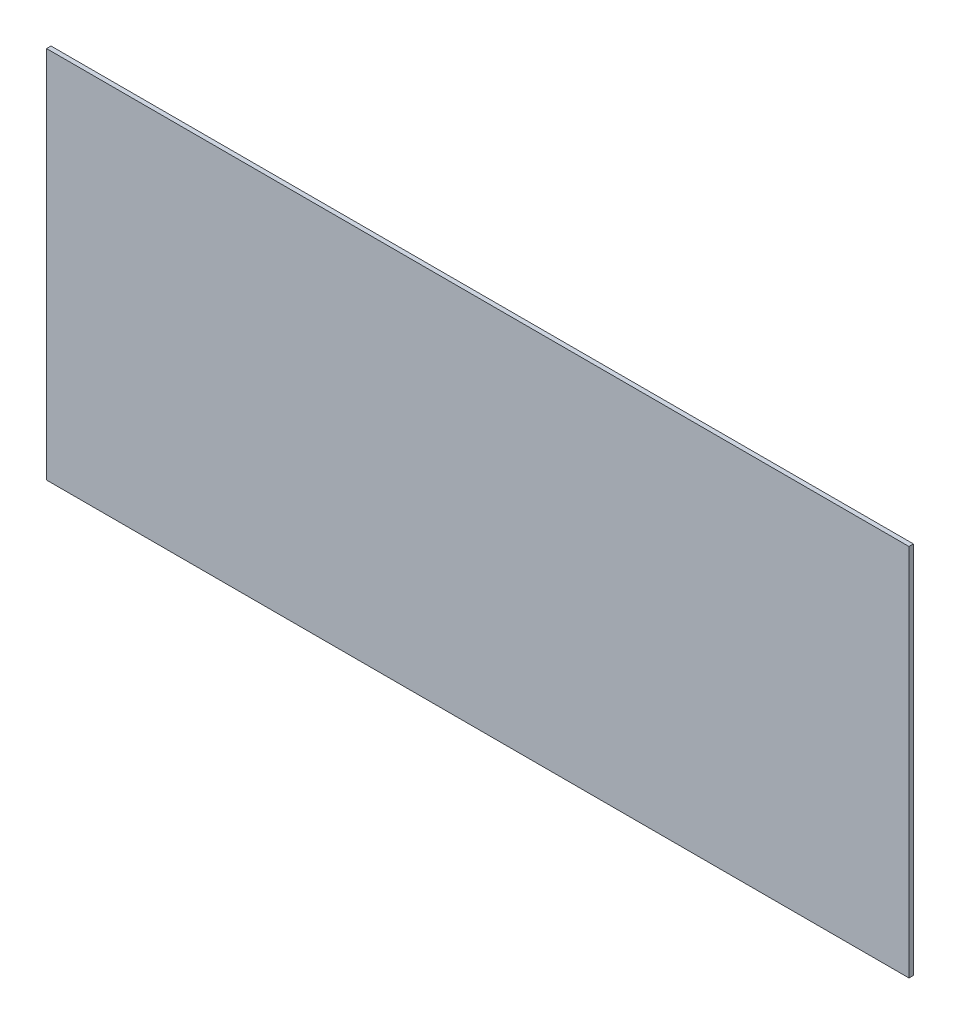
from build123d import *

# Parameters (mm, degrees)
SKETCH1_W            = 198.12
SKETCH1_H            = 2.3622
PANEL_OR_BLOCK_DEPTH = 457.2


with BuildPart() as part:
    # Sketch1 → Panel_or_block (new body)
    with BuildSketch(Plane.YZ):
        with Locations((0, 77.3811)):
            Rectangle(SKETCH1_W, SKETCH1_H)
    extrude(amount=PANEL_OR_BLOCK_DEPTH)


solid = part.part
